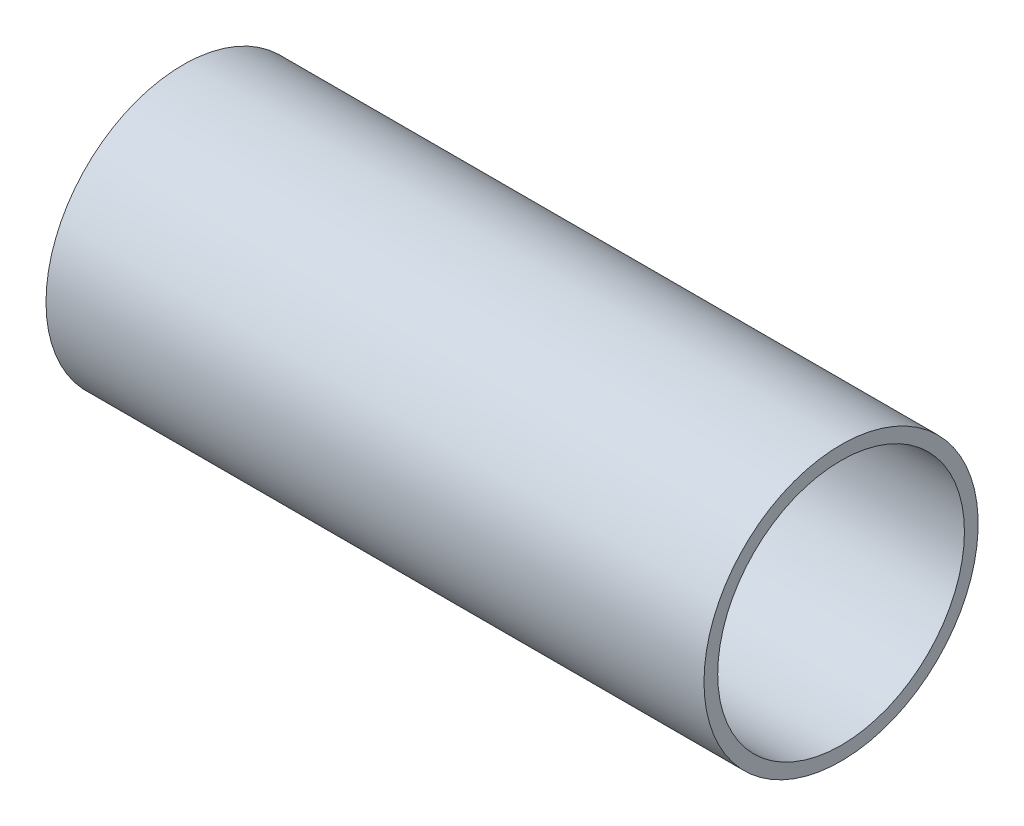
ISO-10303-21;
HEADER;
FILE_DESCRIPTION(('STEP AP214'),'2;1');
FILE_NAME('part.step','',(''),(''),'','','');
FILE_SCHEMA(('AUTOMOTIVE_DESIGN { 1 0 10303 214 1 1 1 1 }'));
ENDSEC;
DATA;
#1=APPLICATION_CONTEXT('core data for automotive mechanical design processes');
#2=APPLICATION_PROTOCOL_DEFINITION('international standard','automotive_design',2000,#1);
#3=PRODUCT_CONTEXT('',#1,'mechanical');
#4=PRODUCT('Part','Part','',(#3));
#5=PRODUCT_RELATED_PRODUCT_CATEGORY('part','',(#4));
#6=PRODUCT_DEFINITION_FORMATION('','',#4);
#7=PRODUCT_DEFINITION_CONTEXT('part definition',#1,'design');
#8=PRODUCT_DEFINITION('design','',#6,#7);
#9=PRODUCT_DEFINITION_SHAPE('','',#8);
#10=(LENGTH_UNIT() NAMED_UNIT(*) SI_UNIT(.MILLI.,.METRE.));
#11=(NAMED_UNIT(*) PLANE_ANGLE_UNIT() SI_UNIT($,.RADIAN.));
#12=(NAMED_UNIT(*) SI_UNIT($,.STERADIAN.) SOLID_ANGLE_UNIT());
#13=UNCERTAINTY_MEASURE_WITH_UNIT(LENGTH_MEASURE(1.E-05),#10,'distance_accuracy_value','');
#14=(GEOMETRIC_REPRESENTATION_CONTEXT(3) GLOBAL_UNCERTAINTY_ASSIGNED_CONTEXT((#13)) GLOBAL_UNIT_ASSIGNED_CONTEXT((#10,
#11,#12)) REPRESENTATION_CONTEXT('',''));
#15=CARTESIAN_POINT('',(0.,0.,0.));
#16=DIRECTION('',(0.,0.,1.));
#17=DIRECTION('',(1.,0.,0.));
#18=AXIS2_PLACEMENT_3D('',#15,#16,#17);
#19=CARTESIAN_POINT('',(76.2,0.,0.));
#20=DIRECTION('',(1.,0.,0.));
#21=DIRECTION('',(0.,0.,-1.));
#22=AXIS2_PLACEMENT_3D('',#19,#20,#21);
#23=PLANE('',#22);
#24=CARTESIAN_POINT('',(76.2,0.,0.));
#25=DIRECTION('',(1.,0.,0.));
#26=DIRECTION('',(0.,0.,-1.));
#27=AXIS2_PLACEMENT_3D('',#24,#25,#26);
#28=CIRCLE('',#27,15.875);
#29=CARTESIAN_POINT('',(76.2,0.,15.875));
#30=VERTEX_POINT('',#29);
#31=EDGE_CURVE('E10',#30,#30,#28,.T.);
#32=ORIENTED_EDGE('',*,*,#31,.T.);
#33=EDGE_LOOP('',(#32));
#34=FACE_BOUND('',#33,.T.);
#35=CARTESIAN_POINT('',(76.2,0.,0.));
#36=DIRECTION('',(1.,0.,0.));
#37=DIRECTION('',(0.,0.,-1.));
#38=AXIS2_PLACEMENT_3D('',#35,#36,#37);
#39=CIRCLE('',#38,14.2875);
#40=CARTESIAN_POINT('',(76.2,0.,14.2875));
#41=VERTEX_POINT('',#40);
#42=EDGE_CURVE('E37',#41,#41,#39,.T.);
#43=ORIENTED_EDGE('',*,*,#42,.F.);
#44=EDGE_LOOP('',(#43));
#45=FACE_BOUND('',#44,.T.);
#46=ADVANCED_FACE('F26',(#34,#45),#23,.T.);
#47=CARTESIAN_POINT('',(0.,0.,0.));
#48=DIRECTION('',(1.,0.,0.));
#49=DIRECTION('',(0.,0.,-1.));
#50=AXIS2_PLACEMENT_3D('',#47,#48,#49);
#51=PLANE('',#50);
#52=CARTESIAN_POINT('',(0.,0.,0.));
#53=DIRECTION('',(1.,0.,0.));
#54=DIRECTION('',(0.,0.,-1.));
#55=AXIS2_PLACEMENT_3D('',#52,#53,#54);
#56=CIRCLE('',#55,15.875);
#57=CARTESIAN_POINT('',(0.,0.,15.875));
#58=VERTEX_POINT('',#57);
#59=EDGE_CURVE('E33',#58,#58,#56,.T.);
#60=ORIENTED_EDGE('',*,*,#59,.F.);
#61=EDGE_LOOP('',(#60));
#62=FACE_BOUND('',#61,.T.);
#63=CARTESIAN_POINT('',(0.,0.,0.));
#64=DIRECTION('',(1.,0.,0.));
#65=DIRECTION('',(0.,0.,-1.));
#66=AXIS2_PLACEMENT_3D('',#63,#64,#65);
#67=CIRCLE('',#66,14.2875);
#68=CARTESIAN_POINT('',(0.,0.,14.2875));
#69=VERTEX_POINT('',#68);
#70=EDGE_CURVE('E41',#69,#69,#67,.T.);
#71=ORIENTED_EDGE('',*,*,#70,.T.);
#72=EDGE_LOOP('',(#71));
#73=FACE_BOUND('',#72,.T.);
#74=ADVANCED_FACE('F47',(#62,#73),#51,.F.);
#75=CARTESIAN_POINT('',(76.2,0.,0.));
#76=DIRECTION('',(-1.,0.,0.));
#77=DIRECTION('',(0.,0.,1.));
#78=AXIS2_PLACEMENT_3D('',#75,#76,#77);
#79=CYLINDRICAL_SURFACE('',#78,15.875);
#80=CARTESIAN_POINT('',(76.2,0.,15.875));
#81=CARTESIAN_POINT('',(75.40625,0.,15.875));
#82=CARTESIAN_POINT('',(74.6125,0.,15.875));
#83=CARTESIAN_POINT('',(73.025,0.,15.875));
#84=CARTESIAN_POINT('',(72.23125,0.,15.875));
#85=CARTESIAN_POINT('',(70.64375,0.,15.875));
#86=CARTESIAN_POINT('',(69.85,0.,15.875));
#87=CARTESIAN_POINT('',(68.2625,0.,15.875));
#88=CARTESIAN_POINT('',(67.46875,0.,15.875));
#89=CARTESIAN_POINT('',(65.88125,0.,15.875));
#90=CARTESIAN_POINT('',(65.0875,0.,15.875));
#91=CARTESIAN_POINT('',(63.5,0.,15.875));
#92=CARTESIAN_POINT('',(62.70625,0.,15.875));
#93=CARTESIAN_POINT('',(61.11875,0.,15.875));
#94=CARTESIAN_POINT('',(60.325,0.,15.875));
#95=CARTESIAN_POINT('',(58.7375,0.,15.875));
#96=CARTESIAN_POINT('',(57.94375,0.,15.875));
#97=CARTESIAN_POINT('',(56.35625,0.,15.875));
#98=CARTESIAN_POINT('',(55.5625,0.,15.875));
#99=CARTESIAN_POINT('',(53.975,0.,15.875));
#100=CARTESIAN_POINT('',(53.18125,0.,15.875));
#101=CARTESIAN_POINT('',(51.59375,0.,15.875));
#102=CARTESIAN_POINT('',(50.8,0.,15.875));
#103=CARTESIAN_POINT('',(49.2125,0.,15.875));
#104=CARTESIAN_POINT('',(48.41875,0.,15.875));
#105=CARTESIAN_POINT('',(46.83125,0.,15.875));
#106=CARTESIAN_POINT('',(46.0375,0.,15.875));
#107=CARTESIAN_POINT('',(44.45,0.,15.875));
#108=CARTESIAN_POINT('',(43.65625,0.,15.875));
#109=CARTESIAN_POINT('',(42.06875,0.,15.875));
#110=CARTESIAN_POINT('',(41.275,0.,15.875));
#111=CARTESIAN_POINT('',(39.6875,0.,15.875));
#112=CARTESIAN_POINT('',(38.89375,0.,15.875));
#113=CARTESIAN_POINT('',(37.30625,0.,15.875));
#114=CARTESIAN_POINT('',(36.5125,0.,15.875));
#115=CARTESIAN_POINT('',(34.925,0.,15.875));
#116=CARTESIAN_POINT('',(34.13125,0.,15.875));
#117=CARTESIAN_POINT('',(32.54375,0.,15.875));
#118=CARTESIAN_POINT('',(31.75,0.,15.875));
#119=CARTESIAN_POINT('',(30.1625,0.,15.875));
#120=CARTESIAN_POINT('',(29.36875,0.,15.875));
#121=CARTESIAN_POINT('',(27.78125,0.,15.875));
#122=CARTESIAN_POINT('',(26.9875,0.,15.875));
#123=CARTESIAN_POINT('',(25.4,0.,15.875));
#124=CARTESIAN_POINT('',(24.60625,0.,15.875));
#125=CARTESIAN_POINT('',(23.01875,0.,15.875));
#126=CARTESIAN_POINT('',(22.225,0.,15.875));
#127=CARTESIAN_POINT('',(20.6375,0.,15.875));
#128=CARTESIAN_POINT('',(19.84375,0.,15.875));
#129=CARTESIAN_POINT('',(18.25625,0.,15.875));
#130=CARTESIAN_POINT('',(17.4625,0.,15.875));
#131=CARTESIAN_POINT('',(15.875,0.,15.875));
#132=CARTESIAN_POINT('',(15.08125,0.,15.875));
#133=CARTESIAN_POINT('',(13.49375,0.,15.875));
#134=CARTESIAN_POINT('',(12.7,0.,15.875));
#135=CARTESIAN_POINT('',(11.1125,0.,15.875));
#136=CARTESIAN_POINT('',(10.31875,0.,15.875));
#137=CARTESIAN_POINT('',(8.73125,0.,15.875));
#138=CARTESIAN_POINT('',(7.93750000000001,0.,15.875));
#139=CARTESIAN_POINT('',(6.35,0.,15.875));
#140=CARTESIAN_POINT('',(5.55625,0.,15.875));
#141=CARTESIAN_POINT('',(3.96875,0.,15.875));
#142=CARTESIAN_POINT('',(3.175,0.,15.875));
#143=CARTESIAN_POINT('',(1.5875,0.,15.875));
#144=CARTESIAN_POINT('',(0.793750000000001,0.,15.875));
#145=CARTESIAN_POINT('',(0.,0.,15.875));
#146=B_SPLINE_CURVE_WITH_KNOTS('',3,(#80,#81,#82,#83,#84,#85,#86,#87,#88,#89,#90,#91,#92,#93,
#94,#95,#96,#97,#98,#99,#100,#101,#102,#103,#104,#105,#106,#107,#108,#109,#110,#111,#112,#113,
#114,#115,#116,#117,#118,#119,#120,#121,#122,#123,#124,#125,#126,#127,#128,#129,#130,#131,#132,
#133,#134,#135,#136,#137,#138,#139,#140,#141,#142,#143,#144,#145),.UNSPECIFIED.,.F.,.F.,(4,2,2,
2,2,2,2,2,2,2,2,2,2,2,2,2,2,2,2,2,2,2,2,2,2,2,2,2,2,2,2,2,4),(0.,2.38125,4.7625,7.14375,
9.52500000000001,11.90625,14.2875,16.66875,19.05,21.43125,23.8125,26.19375,28.575,30.95625,
33.3375,35.71875,38.1,40.48125,42.8625,45.24375,47.625,50.00625,52.3875,54.76875,57.15,59.53125,
61.9125,64.29375,66.675,69.05625,71.4375,73.81875,76.2),.UNSPECIFIED.);
#147=EDGE_CURVE('BSEAM28',#30,#58,#146,.T.);
#148=ORIENTED_EDGE('',*,*,#31,.F.);
#149=ORIENTED_EDGE('',*,*,#59,.T.);
#150=ORIENTED_EDGE('',*,*,#147,.T.);
#151=ORIENTED_EDGE('',*,*,#147,.F.);
#152=EDGE_LOOP('',(#148,#150,#149,#151));
#153=FACE_BOUND('',#152,.T.);
#154=ADVANCED_FACE('F28',(#153),#79,.T.);
#155=CARTESIAN_POINT('',(76.2,0.,0.));
#156=DIRECTION('',(-1.,0.,0.));
#157=DIRECTION('',(0.,0.,1.));
#158=AXIS2_PLACEMENT_3D('',#155,#156,#157);
#159=CYLINDRICAL_SURFACE('',#158,14.2875);
#160=CARTESIAN_POINT('',(76.2,0.,14.2875));
#161=CARTESIAN_POINT('',(75.40625,0.,14.2875));
#162=CARTESIAN_POINT('',(74.6125,0.,14.2875));
#163=CARTESIAN_POINT('',(73.025,0.,14.2875));
#164=CARTESIAN_POINT('',(72.23125,0.,14.2875));
#165=CARTESIAN_POINT('',(70.64375,0.,14.2875));
#166=CARTESIAN_POINT('',(69.85,0.,14.2875));
#167=CARTESIAN_POINT('',(68.2625,0.,14.2875));
#168=CARTESIAN_POINT('',(67.46875,0.,14.2875));
#169=CARTESIAN_POINT('',(65.88125,0.,14.2875));
#170=CARTESIAN_POINT('',(65.0875,0.,14.2875));
#171=CARTESIAN_POINT('',(63.5,0.,14.2875));
#172=CARTESIAN_POINT('',(62.70625,0.,14.2875));
#173=CARTESIAN_POINT('',(61.11875,0.,14.2875));
#174=CARTESIAN_POINT('',(60.325,0.,14.2875));
#175=CARTESIAN_POINT('',(58.7375,0.,14.2875));
#176=CARTESIAN_POINT('',(57.94375,0.,14.2875));
#177=CARTESIAN_POINT('',(56.35625,0.,14.2875));
#178=CARTESIAN_POINT('',(55.5625,0.,14.2875));
#179=CARTESIAN_POINT('',(53.975,0.,14.2875));
#180=CARTESIAN_POINT('',(53.18125,0.,14.2875));
#181=CARTESIAN_POINT('',(51.59375,0.,14.2875));
#182=CARTESIAN_POINT('',(50.8,0.,14.2875));
#183=CARTESIAN_POINT('',(49.2125,0.,14.2875));
#184=CARTESIAN_POINT('',(48.41875,0.,14.2875));
#185=CARTESIAN_POINT('',(46.83125,0.,14.2875));
#186=CARTESIAN_POINT('',(46.0375,0.,14.2875));
#187=CARTESIAN_POINT('',(44.45,0.,14.2875));
#188=CARTESIAN_POINT('',(43.65625,0.,14.2875));
#189=CARTESIAN_POINT('',(42.06875,0.,14.2875));
#190=CARTESIAN_POINT('',(41.275,0.,14.2875));
#191=CARTESIAN_POINT('',(39.6875,0.,14.2875));
#192=CARTESIAN_POINT('',(38.89375,0.,14.2875));
#193=CARTESIAN_POINT('',(37.30625,0.,14.2875));
#194=CARTESIAN_POINT('',(36.5125,0.,14.2875));
#195=CARTESIAN_POINT('',(34.925,0.,14.2875));
#196=CARTESIAN_POINT('',(34.13125,0.,14.2875));
#197=CARTESIAN_POINT('',(32.54375,0.,14.2875));
#198=CARTESIAN_POINT('',(31.75,0.,14.2875));
#199=CARTESIAN_POINT('',(30.1625,0.,14.2875));
#200=CARTESIAN_POINT('',(29.36875,0.,14.2875));
#201=CARTESIAN_POINT('',(27.78125,0.,14.2875));
#202=CARTESIAN_POINT('',(26.9875,0.,14.2875));
#203=CARTESIAN_POINT('',(25.4,0.,14.2875));
#204=CARTESIAN_POINT('',(24.60625,0.,14.2875));
#205=CARTESIAN_POINT('',(23.01875,0.,14.2875));
#206=CARTESIAN_POINT('',(22.225,0.,14.2875));
#207=CARTESIAN_POINT('',(20.6375,0.,14.2875));
#208=CARTESIAN_POINT('',(19.84375,0.,14.2875));
#209=CARTESIAN_POINT('',(18.25625,0.,14.2875));
#210=CARTESIAN_POINT('',(17.4625,0.,14.2875));
#211=CARTESIAN_POINT('',(15.875,0.,14.2875));
#212=CARTESIAN_POINT('',(15.08125,0.,14.2875));
#213=CARTESIAN_POINT('',(13.49375,0.,14.2875));
#214=CARTESIAN_POINT('',(12.7,0.,14.2875));
#215=CARTESIAN_POINT('',(11.1125,0.,14.2875));
#216=CARTESIAN_POINT('',(10.31875,0.,14.2875));
#217=CARTESIAN_POINT('',(8.73125,0.,14.2875));
#218=CARTESIAN_POINT('',(7.93750000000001,0.,14.2875));
#219=CARTESIAN_POINT('',(6.35,0.,14.2875));
#220=CARTESIAN_POINT('',(5.55625,0.,14.2875));
#221=CARTESIAN_POINT('',(3.96875,0.,14.2875));
#222=CARTESIAN_POINT('',(3.175,0.,14.2875));
#223=CARTESIAN_POINT('',(1.5875,0.,14.2875));
#224=CARTESIAN_POINT('',(0.793750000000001,0.,14.2875));
#225=CARTESIAN_POINT('',(0.,0.,14.2875));
#226=B_SPLINE_CURVE_WITH_KNOTS('',3,(#160,#161,#162,#163,#164,#165,#166,#167,#168,#169,#170,
#171,#172,#173,#174,#175,#176,#177,#178,#179,#180,#181,#182,#183,#184,#185,#186,#187,#188,#189,
#190,#191,#192,#193,#194,#195,#196,#197,#198,#199,#200,#201,#202,#203,#204,#205,#206,#207,#208,
#209,#210,#211,#212,#213,#214,#215,#216,#217,#218,#219,#220,#221,#222,#223,#224,#225),
.UNSPECIFIED.,.F.,.F.,(4,2,2,2,2,2,2,2,2,2,2,2,2,2,2,2,2,2,2,2,2,2,2,2,2,2,2,2,2,2,2,2,4),(0.,
2.38125,4.7625,7.14375,9.52500000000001,11.90625,14.2875,16.66875,19.05,21.43125,23.8125,
26.19375,28.575,30.95625,33.3375,35.71875,38.1,40.48125,42.8625,45.24375,47.625,50.00625,
52.3875,54.76875,57.15,59.53125,61.9125,64.29375,66.675,69.05625,71.4375,73.81875,76.2),.UNSPECIFIED.);
#227=EDGE_CURVE('BSEAM49',#41,#69,#226,.T.);
#228=ORIENTED_EDGE('',*,*,#42,.T.);
#229=ORIENTED_EDGE('',*,*,#70,.F.);
#230=ORIENTED_EDGE('',*,*,#227,.T.);
#231=ORIENTED_EDGE('',*,*,#227,.F.);
#232=EDGE_LOOP('',(#228,#230,#229,#231));
#233=FACE_BOUND('',#232,.T.);
#234=ADVANCED_FACE('F49',(#233),#159,.F.);
#235=CLOSED_SHELL('',(#46,#74,#154,#234));
#236=MANIFOLD_SOLID_BREP('B2',#235);
#237=ADVANCED_BREP_SHAPE_REPRESENTATION('',(#18,#236),#14);
#238=SHAPE_DEFINITION_REPRESENTATION(#9,#237);
ENDSEC;
END-ISO-10303-21;
